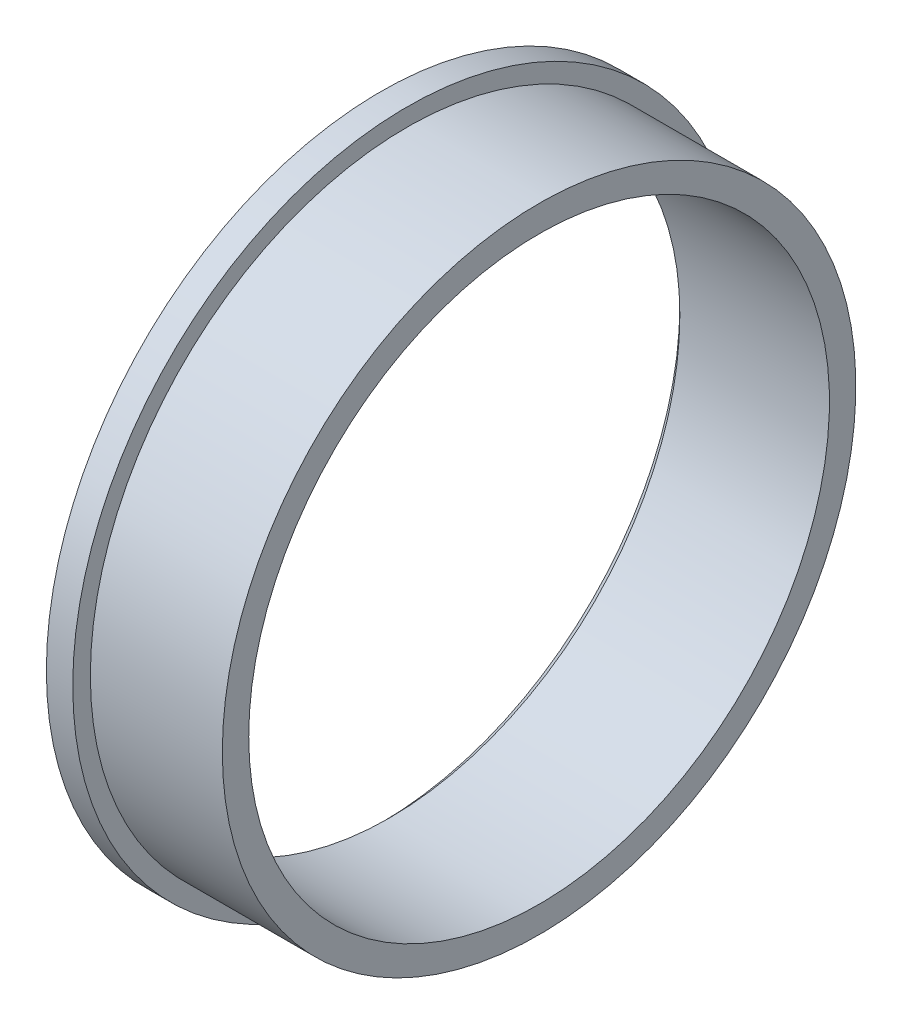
from build123d import *

# Parameters (mm, degrees)
CHANFREIN1_SIZE = 0.5


with BuildPart() as part:
    # Esquisse1 → R_volution1 (revolve)
    with BuildSketch(Plane.XY, mode=Mode.PRIVATE) as r_volution1_sk:
        Polygon((0, 19), (0, 16.5), (9, 16.5), (9, 18), (1.5, 18), (1.5, 19), align=None)
    revolve(r_volution1_sk.sketch.rotate(Axis((-16.572815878, 0, 0), (1, 0, 0)), 90), axis=Axis((-16.572815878, 0, 0), (1, 0, 0)))

    # Chanfrein1
    chanfrein1_edges = [part.edges().sort_by_distance(p)[0] for p in [
        (0, 0, -16.5),
    ]]
    chamfer(chanfrein1_edges, length=CHANFREIN1_SIZE)


solid = part.part
